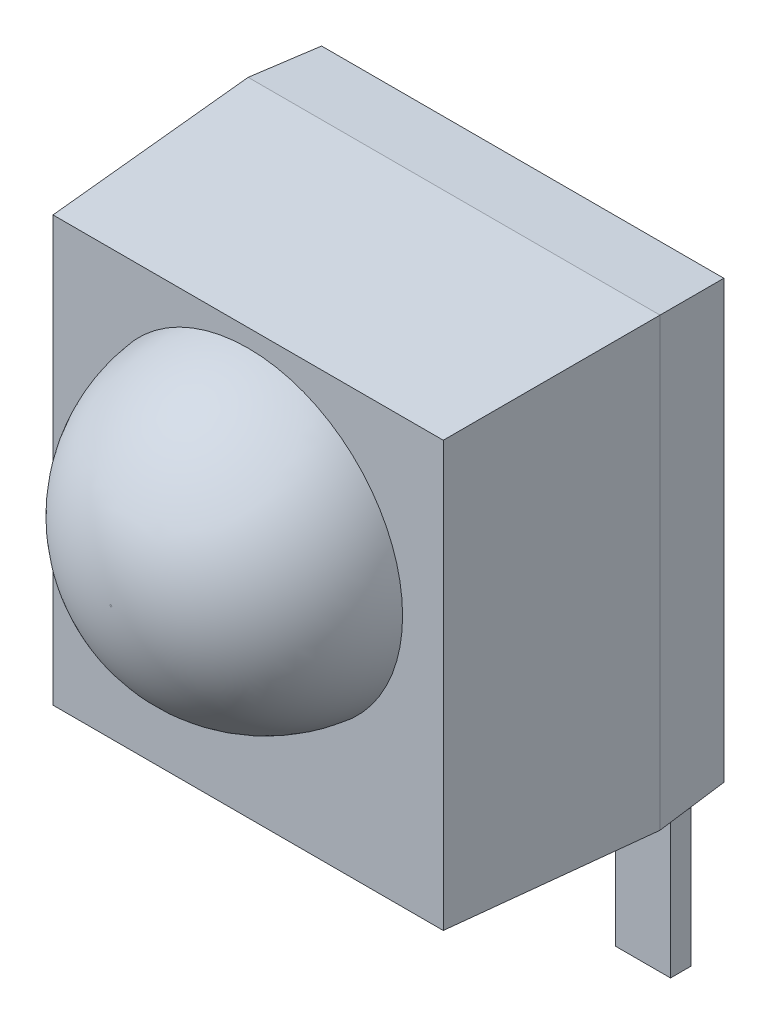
ISO-10303-21;
HEADER;
FILE_DESCRIPTION(('STEP AP214'),'2;1');
FILE_NAME('part.step','',(''),(''),'','','');
FILE_SCHEMA(('AUTOMOTIVE_DESIGN { 1 0 10303 214 1 1 1 1 }'));
ENDSEC;
DATA;
#1=APPLICATION_CONTEXT('core data for automotive mechanical design processes');
#2=APPLICATION_PROTOCOL_DEFINITION('international standard','automotive_design',2000,#1);
#3=PRODUCT_CONTEXT('',#1,'mechanical');
#4=PRODUCT('Part','Part','',(#3));
#5=PRODUCT_RELATED_PRODUCT_CATEGORY('part','',(#4));
#6=PRODUCT_DEFINITION_FORMATION('','',#4);
#7=PRODUCT_DEFINITION_CONTEXT('part definition',#1,'design');
#8=PRODUCT_DEFINITION('design','',#6,#7);
#9=PRODUCT_DEFINITION_SHAPE('','',#8);
#10=(LENGTH_UNIT() NAMED_UNIT(*) SI_UNIT(.MILLI.,.METRE.));
#11=(NAMED_UNIT(*) PLANE_ANGLE_UNIT() SI_UNIT($,.RADIAN.));
#12=(NAMED_UNIT(*) SI_UNIT($,.STERADIAN.) SOLID_ANGLE_UNIT());
#13=UNCERTAINTY_MEASURE_WITH_UNIT(LENGTH_MEASURE(1.E-05),#10,'distance_accuracy_value','');
#14=(GEOMETRIC_REPRESENTATION_CONTEXT(3) GLOBAL_UNCERTAINTY_ASSIGNED_CONTEXT((#13)) GLOBAL_UNIT_ASSIGNED_CONTEXT((#10,
#11,#12)) REPRESENTATION_CONTEXT('',''));
#15=CARTESIAN_POINT('',(0.,0.,0.));
#16=DIRECTION('',(0.,0.,1.));
#17=DIRECTION('',(1.,0.,0.));
#18=AXIS2_PLACEMENT_3D('',#15,#16,#17);
#19=CARTESIAN_POINT('',(0.0599999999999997,-2.,-0.513333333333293));
#20=DIRECTION('',(-1.,0.,0.));
#21=DIRECTION('',(0.,0.,1.));
#22=AXIS2_PLACEMENT_3D('',#19,#20,#21);
#23=PLANE('',#22);
#24=DIRECTION('',(0.,0.,1.));
#25=VECTOR('',#24,1.);
#26=CARTESIAN_POINT('',(0.0599999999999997,0.,-0.513333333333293));
#27=LINE('',#26,#25);
#28=CARTESIAN_POINT('',(0.0599999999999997,0.,-0.513333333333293));
#29=VERTEX_POINT('',#28);
#30=CARTESIAN_POINT('',(0.0599999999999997,0.,-0.213333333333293));
#31=VERTEX_POINT('',#30);
#32=EDGE_CURVE('E77',#29,#31,#27,.T.);
#33=ORIENTED_EDGE('',*,*,#32,.F.);
#34=DIRECTION('',(0.,1.,0.));
#35=VECTOR('',#34,1.);
#36=CARTESIAN_POINT('',(0.0599999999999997,-2.,-0.513333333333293));
#37=LINE('',#36,#35);
#38=CARTESIAN_POINT('',(0.0599999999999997,-2.,-0.513333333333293));
#39=VERTEX_POINT('',#38);
#40=EDGE_CURVE('E12',#39,#29,#37,.T.);
#41=ORIENTED_EDGE('',*,*,#40,.F.);
#42=DIRECTION('',(0.,0.,1.));
#43=VECTOR('',#42,1.);
#44=CARTESIAN_POINT('',(0.0599999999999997,-2.,-0.513333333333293));
#45=LINE('',#44,#43);
#46=CARTESIAN_POINT('',(0.0599999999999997,-2.,-0.213333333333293));
#47=VERTEX_POINT('',#46);
#48=EDGE_CURVE('E79',#39,#47,#45,.T.);
#49=ORIENTED_EDGE('',*,*,#48,.T.);
#50=DIRECTION('',(0.,1.,0.));
#51=VECTOR('',#50,1.);
#52=CARTESIAN_POINT('',(0.0599999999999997,-2.,-0.213333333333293));
#53=LINE('',#52,#51);
#54=EDGE_CURVE('E40',#47,#31,#53,.T.);
#55=ORIENTED_EDGE('',*,*,#54,.T.);
#56=EDGE_LOOP('',(#33,#41,#49,#55));
#57=FACE_BOUND('',#56,.T.);
#58=ADVANCED_FACE('F37',(#57),#23,.T.);
#59=CARTESIAN_POINT('',(0.0599999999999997,-2.,-0.513333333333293));
#60=DIRECTION('',(0.,0.,-1.));
#61=DIRECTION('',(-1.,0.,0.));
#62=AXIS2_PLACEMENT_3D('',#59,#60,#61);
#63=PLANE('',#62);
#64=DIRECTION('',(-1.,0.,0.));
#65=VECTOR('',#64,1.);
#66=CARTESIAN_POINT('',(0.0599999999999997,0.,-0.513333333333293));
#67=LINE('',#66,#65);
#68=CARTESIAN_POINT('',(0.86,0.,-0.513333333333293));
#69=VERTEX_POINT('',#68);
#70=EDGE_CURVE('E94',#69,#29,#67,.T.);
#71=ORIENTED_EDGE('',*,*,#70,.F.);
#72=DIRECTION('',(0.,1.,0.));
#73=VECTOR('',#72,1.);
#74=CARTESIAN_POINT('',(0.86,-2.,-0.513333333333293));
#75=LINE('',#74,#73);
#76=CARTESIAN_POINT('',(0.86,-2.,-0.513333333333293));
#77=VERTEX_POINT('',#76);
#78=EDGE_CURVE('E45',#77,#69,#75,.T.);
#79=ORIENTED_EDGE('',*,*,#78,.F.);
#80=DIRECTION('',(-1.,0.,0.));
#81=VECTOR('',#80,1.);
#82=CARTESIAN_POINT('',(0.0599999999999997,-2.,-0.513333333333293));
#83=LINE('',#82,#81);
#84=EDGE_CURVE('E84',#77,#39,#83,.T.);
#85=ORIENTED_EDGE('',*,*,#84,.T.);
#86=ORIENTED_EDGE('',*,*,#40,.T.);
#87=EDGE_LOOP('',(#71,#79,#85,#86));
#88=FACE_BOUND('',#87,.T.);
#89=ADVANCED_FACE('F109',(#88),#63,.T.);
#90=CARTESIAN_POINT('',(0.86,-2.,-0.513333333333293));
#91=DIRECTION('',(1.,0.,0.));
#92=DIRECTION('',(0.,0.,-1.));
#93=AXIS2_PLACEMENT_3D('',#90,#91,#92);
#94=PLANE('',#93);
#95=DIRECTION('',(0.,0.,-1.));
#96=VECTOR('',#95,1.);
#97=CARTESIAN_POINT('',(0.86,0.,-0.513333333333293));
#98=LINE('',#97,#96);
#99=CARTESIAN_POINT('',(0.86,0.,-0.213333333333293));
#100=VERTEX_POINT('',#99);
#101=EDGE_CURVE('E91',#100,#69,#98,.T.);
#102=ORIENTED_EDGE('',*,*,#101,.F.);
#103=DIRECTION('',(0.,1.,0.));
#104=VECTOR('',#103,1.);
#105=CARTESIAN_POINT('',(0.86,-2.,-0.213333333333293));
#106=LINE('',#105,#104);
#107=CARTESIAN_POINT('',(0.86,-2.,-0.213333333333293));
#108=VERTEX_POINT('',#107);
#109=EDGE_CURVE('E83',#108,#100,#106,.T.);
#110=ORIENTED_EDGE('',*,*,#109,.F.);
#111=DIRECTION('',(0.,0.,-1.));
#112=VECTOR('',#111,1.);
#113=CARTESIAN_POINT('',(0.86,-2.,-0.513333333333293));
#114=LINE('',#113,#112);
#115=EDGE_CURVE('E102',#108,#77,#114,.T.);
#116=ORIENTED_EDGE('',*,*,#115,.T.);
#117=ORIENTED_EDGE('',*,*,#78,.T.);
#118=EDGE_LOOP('',(#102,#110,#116,#117));
#119=FACE_BOUND('',#118,.T.);
#120=ADVANCED_FACE('F106',(#119),#94,.T.);
#121=CARTESIAN_POINT('',(0.0599999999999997,-2.,-0.213333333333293));
#122=DIRECTION('',(0.,0.,1.));
#123=DIRECTION('',(1.,0.,0.));
#124=AXIS2_PLACEMENT_3D('',#121,#122,#123);
#125=PLANE('',#124);
#126=DIRECTION('',(1.,0.,0.));
#127=VECTOR('',#126,1.);
#128=CARTESIAN_POINT('',(0.0599999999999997,0.,-0.213333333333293));
#129=LINE('',#128,#127);
#130=EDGE_CURVE('E86',#31,#100,#129,.T.);
#131=ORIENTED_EDGE('',*,*,#130,.F.);
#132=ORIENTED_EDGE('',*,*,#54,.F.);
#133=DIRECTION('',(1.,0.,0.));
#134=VECTOR('',#133,1.);
#135=CARTESIAN_POINT('',(0.0599999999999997,-2.,-0.213333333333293));
#136=LINE('',#135,#134);
#137=EDGE_CURVE('E100',#47,#108,#136,.T.);
#138=ORIENTED_EDGE('',*,*,#137,.T.);
#139=ORIENTED_EDGE('',*,*,#109,.T.);
#140=EDGE_LOOP('',(#131,#132,#138,#139));
#141=FACE_BOUND('',#140,.T.);
#142=ADVANCED_FACE('F87',(#141),#125,.T.);
#143=CARTESIAN_POINT('',(0.0599999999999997,-2.,-0.213333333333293));
#144=DIRECTION('',(0.,1.,0.));
#145=DIRECTION('',(0.,0.,1.));
#146=AXIS2_PLACEMENT_3D('',#143,#144,#145);
#147=PLANE('',#146);
#148=ORIENTED_EDGE('',*,*,#48,.F.);
#149=ORIENTED_EDGE('',*,*,#84,.F.);
#150=ORIENTED_EDGE('',*,*,#115,.F.);
#151=ORIENTED_EDGE('',*,*,#137,.F.);
#152=EDGE_LOOP('',(#148,#149,#150,#151));
#153=FACE_BOUND('',#152,.T.);
#154=ADVANCED_FACE('F111',(#153),#147,.F.);
#155=CARTESIAN_POINT('',(0.0599999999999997,0.,-0.213333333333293));
#156=DIRECTION('',(0.,1.,0.));
#157=DIRECTION('',(0.,0.,1.));
#158=AXIS2_PLACEMENT_3D('',#155,#156,#157);
#159=PLANE('',#158);
#160=ORIENTED_EDGE('',*,*,#32,.T.);
#161=ORIENTED_EDGE('',*,*,#130,.T.);
#162=ORIENTED_EDGE('',*,*,#101,.T.);
#163=ORIENTED_EDGE('',*,*,#70,.T.);
#164=EDGE_LOOP('',(#160,#161,#162,#163));
#165=FACE_BOUND('',#164,.T.);
#166=ADVANCED_FACE('F93',(#165),#159,.T.);
#167=CLOSED_SHELL('',(#58,#89,#120,#142,#154,#166));
#168=MANIFOLD_SOLID_BREP('B2',#167);
#169=CARTESIAN_POINT('',(5.14,-2.,-0.513333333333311));
#170=DIRECTION('',(-1.,0.,0.));
#171=DIRECTION('',(0.,0.,1.));
#172=AXIS2_PLACEMENT_3D('',#169,#170,#171);
#173=PLANE('',#172);
#174=DIRECTION('',(0.,0.,1.));
#175=VECTOR('',#174,1.);
#176=CARTESIAN_POINT('',(5.14,0.,-0.513333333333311));
#177=LINE('',#176,#175);
#178=CARTESIAN_POINT('',(5.14,0.,-0.513333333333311));
#179=VERTEX_POINT('',#178);
#180=CARTESIAN_POINT('',(5.14,0.,-0.213333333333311));
#181=VERTEX_POINT('',#180);
#182=EDGE_CURVE('E198',#179,#181,#177,.T.);
#183=ORIENTED_EDGE('',*,*,#182,.F.);
#184=DIRECTION('',(0.,1.,0.));
#185=VECTOR('',#184,1.);
#186=CARTESIAN_POINT('',(5.14,-2.,-0.513333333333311));
#187=LINE('',#186,#185);
#188=CARTESIAN_POINT('',(5.14,-2.,-0.513333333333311));
#189=VERTEX_POINT('',#188);
#190=EDGE_CURVE('E35',#189,#179,#187,.T.);
#191=ORIENTED_EDGE('',*,*,#190,.F.);
#192=DIRECTION('',(0.,0.,1.));
#193=VECTOR('',#192,1.);
#194=CARTESIAN_POINT('',(5.14,-2.,-0.513333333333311));
#195=LINE('',#194,#193);
#196=CARTESIAN_POINT('',(5.14,-2.,-0.213333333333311));
#197=VERTEX_POINT('',#196);
#198=EDGE_CURVE('E200',#189,#197,#195,.T.);
#199=ORIENTED_EDGE('',*,*,#198,.T.);
#200=DIRECTION('',(0.,1.,0.));
#201=VECTOR('',#200,1.);
#202=CARTESIAN_POINT('',(5.14,-2.,-0.213333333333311));
#203=LINE('',#202,#201);
#204=EDGE_CURVE('E161',#197,#181,#203,.T.);
#205=ORIENTED_EDGE('',*,*,#204,.T.);
#206=EDGE_LOOP('',(#183,#191,#199,#205));
#207=FACE_BOUND('',#206,.T.);
#208=ADVANCED_FACE('F158',(#207),#173,.T.);
#209=CARTESIAN_POINT('',(5.14,-2.,-0.513333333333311));
#210=DIRECTION('',(0.,0.,-1.));
#211=DIRECTION('',(-1.,0.,0.));
#212=AXIS2_PLACEMENT_3D('',#209,#210,#211);
#213=PLANE('',#212);
#214=DIRECTION('',(-1.,0.,0.));
#215=VECTOR('',#214,1.);
#216=CARTESIAN_POINT('',(5.14,0.,-0.513333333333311));
#217=LINE('',#216,#215);
#218=CARTESIAN_POINT('',(5.94,0.,-0.513333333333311));
#219=VERTEX_POINT('',#218);
#220=EDGE_CURVE('E215',#219,#179,#217,.T.);
#221=ORIENTED_EDGE('',*,*,#220,.F.);
#222=DIRECTION('',(0.,1.,0.));
#223=VECTOR('',#222,1.);
#224=CARTESIAN_POINT('',(5.94,-2.,-0.513333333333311));
#225=LINE('',#224,#223);
#226=CARTESIAN_POINT('',(5.94,-2.,-0.513333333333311));
#227=VERTEX_POINT('',#226);
#228=EDGE_CURVE('E166',#227,#219,#225,.T.);
#229=ORIENTED_EDGE('',*,*,#228,.F.);
#230=DIRECTION('',(-1.,0.,0.));
#231=VECTOR('',#230,1.);
#232=CARTESIAN_POINT('',(5.14,-2.,-0.513333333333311));
#233=LINE('',#232,#231);
#234=EDGE_CURVE('E205',#227,#189,#233,.T.);
#235=ORIENTED_EDGE('',*,*,#234,.T.);
#236=ORIENTED_EDGE('',*,*,#190,.T.);
#237=EDGE_LOOP('',(#221,#229,#235,#236));
#238=FACE_BOUND('',#237,.T.);
#239=ADVANCED_FACE('F230',(#238),#213,.T.);
#240=CARTESIAN_POINT('',(5.94,-2.,-0.513333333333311));
#241=DIRECTION('',(1.,0.,0.));
#242=DIRECTION('',(0.,0.,-1.));
#243=AXIS2_PLACEMENT_3D('',#240,#241,#242);
#244=PLANE('',#243);
#245=DIRECTION('',(0.,0.,-1.));
#246=VECTOR('',#245,1.);
#247=CARTESIAN_POINT('',(5.94,0.,-0.513333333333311));
#248=LINE('',#247,#246);
#249=CARTESIAN_POINT('',(5.94,0.,-0.213333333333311));
#250=VERTEX_POINT('',#249);
#251=EDGE_CURVE('E212',#250,#219,#248,.T.);
#252=ORIENTED_EDGE('',*,*,#251,.F.);
#253=DIRECTION('',(0.,1.,0.));
#254=VECTOR('',#253,1.);
#255=CARTESIAN_POINT('',(5.94,-2.,-0.213333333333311));
#256=LINE('',#255,#254);
#257=CARTESIAN_POINT('',(5.94,-2.,-0.213333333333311));
#258=VERTEX_POINT('',#257);
#259=EDGE_CURVE('E204',#258,#250,#256,.T.);
#260=ORIENTED_EDGE('',*,*,#259,.F.);
#261=DIRECTION('',(0.,0.,-1.));
#262=VECTOR('',#261,1.);
#263=CARTESIAN_POINT('',(5.94,-2.,-0.513333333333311));
#264=LINE('',#263,#262);
#265=EDGE_CURVE('E223',#258,#227,#264,.T.);
#266=ORIENTED_EDGE('',*,*,#265,.T.);
#267=ORIENTED_EDGE('',*,*,#228,.T.);
#268=EDGE_LOOP('',(#252,#260,#266,#267));
#269=FACE_BOUND('',#268,.T.);
#270=ADVANCED_FACE('F227',(#269),#244,.T.);
#271=CARTESIAN_POINT('',(5.14,-2.,-0.213333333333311));
#272=DIRECTION('',(0.,0.,1.));
#273=DIRECTION('',(1.,0.,0.));
#274=AXIS2_PLACEMENT_3D('',#271,#272,#273);
#275=PLANE('',#274);
#276=DIRECTION('',(1.,0.,0.));
#277=VECTOR('',#276,1.);
#278=CARTESIAN_POINT('',(5.14,0.,-0.213333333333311));
#279=LINE('',#278,#277);
#280=EDGE_CURVE('E207',#181,#250,#279,.T.);
#281=ORIENTED_EDGE('',*,*,#280,.F.);
#282=ORIENTED_EDGE('',*,*,#204,.F.);
#283=DIRECTION('',(1.,0.,0.));
#284=VECTOR('',#283,1.);
#285=CARTESIAN_POINT('',(5.14,-2.,-0.213333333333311));
#286=LINE('',#285,#284);
#287=EDGE_CURVE('E221',#197,#258,#286,.T.);
#288=ORIENTED_EDGE('',*,*,#287,.T.);
#289=ORIENTED_EDGE('',*,*,#259,.T.);
#290=EDGE_LOOP('',(#281,#282,#288,#289));
#291=FACE_BOUND('',#290,.T.);
#292=ADVANCED_FACE('F208',(#291),#275,.T.);
#293=CARTESIAN_POINT('',(5.14,-2.,-0.213333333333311));
#294=DIRECTION('',(0.,1.,0.));
#295=DIRECTION('',(0.,0.,1.));
#296=AXIS2_PLACEMENT_3D('',#293,#294,#295);
#297=PLANE('',#296);
#298=ORIENTED_EDGE('',*,*,#198,.F.);
#299=ORIENTED_EDGE('',*,*,#234,.F.);
#300=ORIENTED_EDGE('',*,*,#265,.F.);
#301=ORIENTED_EDGE('',*,*,#287,.F.);
#302=EDGE_LOOP('',(#298,#299,#300,#301));
#303=FACE_BOUND('',#302,.T.);
#304=ADVANCED_FACE('F232',(#303),#297,.F.);
#305=CARTESIAN_POINT('',(5.14,0.,-0.213333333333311));
#306=DIRECTION('',(0.,1.,0.));
#307=DIRECTION('',(0.,0.,1.));
#308=AXIS2_PLACEMENT_3D('',#305,#306,#307);
#309=PLANE('',#308);
#310=ORIENTED_EDGE('',*,*,#182,.T.);
#311=ORIENTED_EDGE('',*,*,#280,.T.);
#312=ORIENTED_EDGE('',*,*,#251,.T.);
#313=ORIENTED_EDGE('',*,*,#220,.T.);
#314=EDGE_LOOP('',(#310,#311,#312,#313));
#315=FACE_BOUND('',#314,.T.);
#316=ADVANCED_FACE('F214',(#315),#309,.T.);
#317=CLOSED_SHELL('',(#208,#239,#270,#292,#304,#316));
#318=MANIFOLD_SOLID_BREP('B6',#317);
#319=CARTESIAN_POINT('',(2.6,-2.,-0.513333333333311));
#320=DIRECTION('',(-1.,0.,0.));
#321=DIRECTION('',(0.,0.,1.));
#322=AXIS2_PLACEMENT_3D('',#319,#320,#321);
#323=PLANE('',#322);
#324=DIRECTION('',(0.,0.,1.));
#325=VECTOR('',#324,1.);
#326=CARTESIAN_POINT('',(2.6,0.,-0.513333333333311));
#327=LINE('',#326,#325);
#328=CARTESIAN_POINT('',(2.6,0.,-0.513333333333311));
#329=VERTEX_POINT('',#328);
#330=CARTESIAN_POINT('',(2.6,0.,-0.213333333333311));
#331=VERTEX_POINT('',#330);
#332=EDGE_CURVE('E318',#329,#331,#327,.T.);
#333=ORIENTED_EDGE('',*,*,#332,.F.);
#334=DIRECTION('',(0.,1.,0.));
#335=VECTOR('',#334,1.);
#336=CARTESIAN_POINT('',(2.6,-2.,-0.513333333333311));
#337=LINE('',#336,#335);
#338=CARTESIAN_POINT('',(2.6,-2.,-0.513333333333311));
#339=VERTEX_POINT('',#338);
#340=EDGE_CURVE('E156',#339,#329,#337,.T.);
#341=ORIENTED_EDGE('',*,*,#340,.F.);
#342=DIRECTION('',(0.,0.,1.));
#343=VECTOR('',#342,1.);
#344=CARTESIAN_POINT('',(2.6,-2.,-0.513333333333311));
#345=LINE('',#344,#343);
#346=CARTESIAN_POINT('',(2.6,-2.,-0.213333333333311));
#347=VERTEX_POINT('',#346);
#348=EDGE_CURVE('E320',#339,#347,#345,.T.);
#349=ORIENTED_EDGE('',*,*,#348,.T.);
#350=DIRECTION('',(0.,1.,0.));
#351=VECTOR('',#350,1.);
#352=CARTESIAN_POINT('',(2.6,-2.,-0.213333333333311));
#353=LINE('',#352,#351);
#354=EDGE_CURVE('E281',#347,#331,#353,.T.);
#355=ORIENTED_EDGE('',*,*,#354,.T.);
#356=EDGE_LOOP('',(#333,#341,#349,#355));
#357=FACE_BOUND('',#356,.T.);
#358=ADVANCED_FACE('F278',(#357),#323,.T.);
#359=CARTESIAN_POINT('',(2.6,-2.,-0.513333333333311));
#360=DIRECTION('',(0.,0.,-1.));
#361=DIRECTION('',(-1.,0.,0.));
#362=AXIS2_PLACEMENT_3D('',#359,#360,#361);
#363=PLANE('',#362);
#364=DIRECTION('',(-1.,0.,0.));
#365=VECTOR('',#364,1.);
#366=CARTESIAN_POINT('',(2.6,0.,-0.513333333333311));
#367=LINE('',#366,#365);
#368=CARTESIAN_POINT('',(3.4,0.,-0.513333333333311));
#369=VERTEX_POINT('',#368);
#370=EDGE_CURVE('E335',#369,#329,#367,.T.);
#371=ORIENTED_EDGE('',*,*,#370,.F.);
#372=DIRECTION('',(0.,1.,0.));
#373=VECTOR('',#372,1.);
#374=CARTESIAN_POINT('',(3.4,-2.,-0.513333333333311));
#375=LINE('',#374,#373);
#376=CARTESIAN_POINT('',(3.4,-2.,-0.513333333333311));
#377=VERTEX_POINT('',#376);
#378=EDGE_CURVE('E286',#377,#369,#375,.T.);
#379=ORIENTED_EDGE('',*,*,#378,.F.);
#380=DIRECTION('',(-1.,0.,0.));
#381=VECTOR('',#380,1.);
#382=CARTESIAN_POINT('',(2.6,-2.,-0.513333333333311));
#383=LINE('',#382,#381);
#384=EDGE_CURVE('E325',#377,#339,#383,.T.);
#385=ORIENTED_EDGE('',*,*,#384,.T.);
#386=ORIENTED_EDGE('',*,*,#340,.T.);
#387=EDGE_LOOP('',(#371,#379,#385,#386));
#388=FACE_BOUND('',#387,.T.);
#389=ADVANCED_FACE('F350',(#388),#363,.T.);
#390=CARTESIAN_POINT('',(3.4,-2.,-0.513333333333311));
#391=DIRECTION('',(1.,0.,0.));
#392=DIRECTION('',(0.,0.,-1.));
#393=AXIS2_PLACEMENT_3D('',#390,#391,#392);
#394=PLANE('',#393);
#395=DIRECTION('',(0.,0.,-1.));
#396=VECTOR('',#395,1.);
#397=CARTESIAN_POINT('',(3.4,0.,-0.513333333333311));
#398=LINE('',#397,#396);
#399=CARTESIAN_POINT('',(3.4,0.,-0.213333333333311));
#400=VERTEX_POINT('',#399);
#401=EDGE_CURVE('E332',#400,#369,#398,.T.);
#402=ORIENTED_EDGE('',*,*,#401,.F.);
#403=DIRECTION('',(0.,1.,0.));
#404=VECTOR('',#403,1.);
#405=CARTESIAN_POINT('',(3.4,-2.,-0.213333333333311));
#406=LINE('',#405,#404);
#407=CARTESIAN_POINT('',(3.4,-2.,-0.213333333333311));
#408=VERTEX_POINT('',#407);
#409=EDGE_CURVE('E324',#408,#400,#406,.T.);
#410=ORIENTED_EDGE('',*,*,#409,.F.);
#411=DIRECTION('',(0.,0.,-1.));
#412=VECTOR('',#411,1.);
#413=CARTESIAN_POINT('',(3.4,-2.,-0.513333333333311));
#414=LINE('',#413,#412);
#415=EDGE_CURVE('E343',#408,#377,#414,.T.);
#416=ORIENTED_EDGE('',*,*,#415,.T.);
#417=ORIENTED_EDGE('',*,*,#378,.T.);
#418=EDGE_LOOP('',(#402,#410,#416,#417));
#419=FACE_BOUND('',#418,.T.);
#420=ADVANCED_FACE('F347',(#419),#394,.T.);
#421=CARTESIAN_POINT('',(2.6,-2.,-0.213333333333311));
#422=DIRECTION('',(0.,0.,1.));
#423=DIRECTION('',(1.,0.,0.));
#424=AXIS2_PLACEMENT_3D('',#421,#422,#423);
#425=PLANE('',#424);
#426=DIRECTION('',(1.,0.,0.));
#427=VECTOR('',#426,1.);
#428=CARTESIAN_POINT('',(2.6,0.,-0.213333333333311));
#429=LINE('',#428,#427);
#430=EDGE_CURVE('E327',#331,#400,#429,.T.);
#431=ORIENTED_EDGE('',*,*,#430,.F.);
#432=ORIENTED_EDGE('',*,*,#354,.F.);
#433=DIRECTION('',(1.,0.,0.));
#434=VECTOR('',#433,1.);
#435=CARTESIAN_POINT('',(2.6,-2.,-0.213333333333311));
#436=LINE('',#435,#434);
#437=EDGE_CURVE('E341',#347,#408,#436,.T.);
#438=ORIENTED_EDGE('',*,*,#437,.T.);
#439=ORIENTED_EDGE('',*,*,#409,.T.);
#440=EDGE_LOOP('',(#431,#432,#438,#439));
#441=FACE_BOUND('',#440,.T.);
#442=ADVANCED_FACE('F328',(#441),#425,.T.);
#443=CARTESIAN_POINT('',(2.6,-2.,-0.213333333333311));
#444=DIRECTION('',(0.,1.,0.));
#445=DIRECTION('',(0.,0.,1.));
#446=AXIS2_PLACEMENT_3D('',#443,#444,#445);
#447=PLANE('',#446);
#448=ORIENTED_EDGE('',*,*,#348,.F.);
#449=ORIENTED_EDGE('',*,*,#384,.F.);
#450=ORIENTED_EDGE('',*,*,#415,.F.);
#451=ORIENTED_EDGE('',*,*,#437,.F.);
#452=EDGE_LOOP('',(#448,#449,#450,#451));
#453=FACE_BOUND('',#452,.T.);
#454=ADVANCED_FACE('F352',(#453),#447,.F.);
#455=CARTESIAN_POINT('',(2.6,0.,-0.213333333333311));
#456=DIRECTION('',(0.,1.,0.));
#457=DIRECTION('',(0.,0.,1.));
#458=AXIS2_PLACEMENT_3D('',#455,#456,#457);
#459=PLANE('',#458);
#460=ORIENTED_EDGE('',*,*,#332,.T.);
#461=ORIENTED_EDGE('',*,*,#430,.T.);
#462=ORIENTED_EDGE('',*,*,#401,.T.);
#463=ORIENTED_EDGE('',*,*,#370,.T.);
#464=EDGE_LOOP('',(#460,#461,#462,#463));
#465=FACE_BOUND('',#464,.T.);
#466=ADVANCED_FACE('F334',(#465),#459,.T.);
#467=CLOSED_SHELL('',(#358,#389,#420,#442,#454,#466));
#468=MANIFOLD_SOLID_BREP('B29',#467);
#469=CARTESIAN_POINT('',(0.,6.5,3.));
#470=DIRECTION('',(0.,0.,-1.));
#471=DIRECTION('',(-1.,0.,0.));
#472=AXIS2_PLACEMENT_3D('',#469,#470,#471);
#473=PLANE('',#472);
#474=DIRECTION('',(0.,1.,0.));
#475=VECTOR('',#474,1.);
#476=CARTESIAN_POINT('',(0.157223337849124,6.5,3.));
#477=LINE('',#476,#475);
#478=CARTESIAN_POINT('',(0.157223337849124,6.34277666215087,3.));
#479=VERTEX_POINT('',#478);
#480=CARTESIAN_POINT('',(0.157223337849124,0.157223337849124,3.));
#481=VERTEX_POINT('',#480);
#482=EDGE_CURVE('E487',#479,#481,#477,.F.);
#483=ORIENTED_EDGE('',*,*,#482,.T.);
#484=DIRECTION('',(-1.,0.,0.));
#485=VECTOR('',#484,1.);
#486=CARTESIAN_POINT('',(0.,0.157223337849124,3.));
#487=LINE('',#486,#485);
#488=CARTESIAN_POINT('',(5.84277666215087,0.157223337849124,3.));
#489=VERTEX_POINT('',#488);
#490=EDGE_CURVE('E468',#481,#489,#487,.F.);
#491=ORIENTED_EDGE('',*,*,#490,.T.);
#492=DIRECTION('',(0.,-1.,0.));
#493=VECTOR('',#492,1.);
#494=CARTESIAN_POINT('',(5.84277666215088,6.5,3.));
#495=LINE('',#494,#493);
#496=CARTESIAN_POINT('',(5.84277666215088,6.34277666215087,3.));
#497=VERTEX_POINT('',#496);
#498=EDGE_CURVE('E409',#489,#497,#495,.F.);
#499=ORIENTED_EDGE('',*,*,#498,.T.);
#500=DIRECTION('',(1.,0.,0.));
#501=VECTOR('',#500,1.);
#502=CARTESIAN_POINT('',(0.,6.34277666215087,3.));
#503=LINE('',#502,#501);
#504=EDGE_CURVE('E404',#497,#479,#503,.F.);
#505=ORIENTED_EDGE('',*,*,#504,.T.);
#506=EDGE_LOOP('',(#483,#491,#499,#505));
#507=FACE_BOUND('',#506,.T.);
#508=CARTESIAN_POINT('',(3.,3.83355555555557,3.));
#509=DIRECTION('',(0.,0.,-1.));
#510=DIRECTION('',(-1.,0.,0.));
#511=AXIS2_PLACEMENT_3D('',#508,#509,#510);
#512=CIRCLE('',#511,2.25);
#513=CARTESIAN_POINT('',(0.75,3.83355555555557,3.));
#514=VERTEX_POINT('',#513);
#515=EDGE_CURVE('E397',#514,#514,#512,.F.);
#516=ORIENTED_EDGE('',*,*,#515,.F.);
#517=EDGE_LOOP('',(#516));
#518=FACE_BOUND('',#517,.T.);
#519=ADVANCED_FACE('F389',(#507,#518),#473,.F.);
#520=CARTESIAN_POINT('',(0.,0.,0.));
#521=DIRECTION('',(-0.998629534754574,0.,0.0523359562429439));
#522=DIRECTION('',(0.0523359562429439,0.,0.998629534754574));
#523=AXIS2_PLACEMENT_3D('',#520,#521,#522);
#524=PLANE('',#523);
#525=DIRECTION('',(0.,-1.,0.));
#526=VECTOR('',#525,1.);
#527=CARTESIAN_POINT('',(0.,0.,0.));
#528=LINE('',#527,#526);
#529=CARTESIAN_POINT('',(0.,6.5,0.));
#530=VERTEX_POINT('',#529);
#531=CARTESIAN_POINT('',(0.,0.,0.));
#532=VERTEX_POINT('',#531);
#533=EDGE_CURVE('E446',#530,#532,#528,.T.);
#534=ORIENTED_EDGE('',*,*,#533,.T.);
#535=DIRECTION('',(-0.052264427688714,-0.052264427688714,-0.997264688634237));
#536=VECTOR('',#535,1.);
#537=CARTESIAN_POINT('',(0.,0.,0.));
#538=LINE('',#537,#536);
#539=EDGE_CURVE('E467',#481,#532,#538,.T.);
#540=ORIENTED_EDGE('',*,*,#539,.F.);
#541=ORIENTED_EDGE('',*,*,#482,.F.);
#542=DIRECTION('',(-0.052264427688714,0.052264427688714,-0.997264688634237));
#543=VECTOR('',#542,1.);
#544=CARTESIAN_POINT('',(0.0177552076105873,6.48224479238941,0.338789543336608));
#545=LINE('',#544,#543);
#546=EDGE_CURVE('E475',#479,#530,#545,.T.);
#547=ORIENTED_EDGE('',*,*,#546,.T.);
#548=EDGE_LOOP('',(#534,#540,#541,#547));
#549=FACE_BOUND('',#548,.T.);
#550=ADVANCED_FACE('F474',(#549),#524,.T.);
#551=CARTESIAN_POINT('',(0.,0.,0.));
#552=DIRECTION('',(0.,-0.998629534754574,0.0523359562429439));
#553=DIRECTION('',(0.,-0.0523359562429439,-0.998629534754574));
#554=AXIS2_PLACEMENT_3D('',#551,#552,#553);
#555=PLANE('',#554);
#556=DIRECTION('',(1.,0.,0.));
#557=VECTOR('',#556,1.);
#558=CARTESIAN_POINT('',(0.,0.,0.));
#559=LINE('',#558,#557);
#560=CARTESIAN_POINT('',(6.,0.,0.));
#561=VERTEX_POINT('',#560);
#562=EDGE_CURVE('E458',#532,#561,#559,.T.);
#563=ORIENTED_EDGE('',*,*,#562,.T.);
#564=DIRECTION('',(0.052264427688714,-0.052264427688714,-0.997264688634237));
#565=VECTOR('',#564,1.);
#566=CARTESIAN_POINT('',(6.,0.,0.));
#567=LINE('',#566,#565);
#568=EDGE_CURVE('E471',#489,#561,#567,.T.);
#569=ORIENTED_EDGE('',*,*,#568,.F.);
#570=ORIENTED_EDGE('',*,*,#490,.F.);
#571=ORIENTED_EDGE('',*,*,#539,.T.);
#572=EDGE_LOOP('',(#563,#569,#570,#571));
#573=FACE_BOUND('',#572,.T.);
#574=ADVANCED_FACE('F391',(#573),#555,.T.);
#575=CARTESIAN_POINT('',(6.,0.,0.));
#576=DIRECTION('',(0.998629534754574,0.,0.0523359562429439));
#577=DIRECTION('',(0.0523359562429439,0.,-0.998629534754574));
#578=AXIS2_PLACEMENT_3D('',#575,#576,#577);
#579=PLANE('',#578);
#580=DIRECTION('',(0.,1.,0.));
#581=VECTOR('',#580,1.);
#582=CARTESIAN_POINT('',(6.,0.,0.));
#583=LINE('',#582,#581);
#584=CARTESIAN_POINT('',(6.,6.5,0.));
#585=VERTEX_POINT('',#584);
#586=EDGE_CURVE('E464',#561,#585,#583,.T.);
#587=ORIENTED_EDGE('',*,*,#586,.T.);
#588=DIRECTION('',(0.0522644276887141,0.052264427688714,-0.997264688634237));
#589=VECTOR('',#588,1.);
#590=CARTESIAN_POINT('',(5.98361057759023,6.48361057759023,0.312728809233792));
#591=LINE('',#590,#589);
#592=EDGE_CURVE('E490',#497,#585,#591,.T.);
#593=ORIENTED_EDGE('',*,*,#592,.F.);
#594=ORIENTED_EDGE('',*,*,#498,.F.);
#595=ORIENTED_EDGE('',*,*,#568,.T.);
#596=EDGE_LOOP('',(#587,#593,#594,#595));
#597=FACE_BOUND('',#596,.T.);
#598=ADVANCED_FACE('F517',(#597),#579,.T.);
#599=CARTESIAN_POINT('',(0.,6.5,0.));
#600=DIRECTION('',(0.,0.998629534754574,0.0523359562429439));
#601=DIRECTION('',(0.,-0.0523359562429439,0.998629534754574));
#602=AXIS2_PLACEMENT_3D('',#599,#600,#601);
#603=PLANE('',#602);
#604=DIRECTION('',(-1.,0.,0.));
#605=VECTOR('',#604,1.);
#606=CARTESIAN_POINT('',(0.,6.5,0.));
#607=LINE('',#606,#605);
#608=EDGE_CURVE('E486',#585,#530,#607,.T.);
#609=ORIENTED_EDGE('',*,*,#608,.T.);
#610=ORIENTED_EDGE('',*,*,#546,.F.);
#611=ORIENTED_EDGE('',*,*,#504,.F.);
#612=ORIENTED_EDGE('',*,*,#592,.T.);
#613=EDGE_LOOP('',(#609,#610,#611,#612));
#614=FACE_BOUND('',#613,.T.);
#615=ADVANCED_FACE('F515',(#614),#603,.T.);
#616=CARTESIAN_POINT('',(0.,0.,0.));
#617=DIRECTION('',(-0.997564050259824,0.,-0.0697564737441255));
#618=DIRECTION('',(-0.0697564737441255,0.,0.997564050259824));
#619=AXIS2_PLACEMENT_3D('',#616,#617,#618);
#620=PLANE('',#619);
#621=ORIENTED_EDGE('',*,*,#533,.F.);
#622=DIRECTION('',(-0.0695873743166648,0.0695873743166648,0.995145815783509));
#623=VECTOR('',#622,1.);
#624=CARTESIAN_POINT('',(0.,6.5,0.));
#625=LINE('',#624,#623);
#626=CARTESIAN_POINT('',(0.0699268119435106,6.43007318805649,-1.));
#627=VERTEX_POINT('',#626);
#628=EDGE_CURVE('E476',#627,#530,#625,.T.);
#629=ORIENTED_EDGE('',*,*,#628,.F.);
#630=DIRECTION('',(0.,-1.,0.));
#631=VECTOR('',#630,1.);
#632=CARTESIAN_POINT('',(0.0699268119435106,0.,-1.));
#633=LINE('',#632,#631);
#634=CARTESIAN_POINT('',(0.0699268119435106,0.0699268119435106,-1.));
#635=VERTEX_POINT('',#634);
#636=EDGE_CURVE('E449',#627,#635,#633,.T.);
#637=ORIENTED_EDGE('',*,*,#636,.T.);
#638=DIRECTION('',(-0.0695873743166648,-0.0695873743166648,0.995145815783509));
#639=VECTOR('',#638,1.);
#640=CARTESIAN_POINT('',(0.,0.,0.));
#641=LINE('',#640,#639);
#642=EDGE_CURVE('E442',#635,#532,#641,.T.);
#643=ORIENTED_EDGE('',*,*,#642,.T.);
#644=EDGE_LOOP('',(#621,#629,#637,#643));
#645=FACE_BOUND('',#644,.T.);
#646=ADVANCED_FACE('F444',(#645),#620,.T.);
#647=CARTESIAN_POINT('',(0.,6.5,0.));
#648=DIRECTION('',(0.,0.997564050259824,-0.0697564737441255));
#649=DIRECTION('',(0.,0.0697564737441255,0.997564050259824));
#650=AXIS2_PLACEMENT_3D('',#647,#648,#649);
#651=PLANE('',#650);
#652=ORIENTED_EDGE('',*,*,#608,.F.);
#653=DIRECTION('',(0.0695873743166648,0.0695873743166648,0.995145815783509));
#654=VECTOR('',#653,1.);
#655=CARTESIAN_POINT('',(5.96852438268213,6.46852438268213,-0.450122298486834));
#656=LINE('',#655,#654);
#657=CARTESIAN_POINT('',(5.93007318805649,6.43007318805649,-1.));
#658=VERTEX_POINT('',#657);
#659=EDGE_CURVE('E478',#658,#585,#656,.T.);
#660=ORIENTED_EDGE('',*,*,#659,.F.);
#661=DIRECTION('',(-1.,0.,0.));
#662=VECTOR('',#661,1.);
#663=CARTESIAN_POINT('',(0.,6.43007318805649,-1.));
#664=LINE('',#663,#662);
#665=EDGE_CURVE('E454',#658,#627,#664,.T.);
#666=ORIENTED_EDGE('',*,*,#665,.T.);
#667=ORIENTED_EDGE('',*,*,#628,.T.);
#668=EDGE_LOOP('',(#652,#660,#666,#667));
#669=FACE_BOUND('',#668,.T.);
#670=ADVANCED_FACE('F512',(#669),#651,.T.);
#671=CARTESIAN_POINT('',(6.,0.,0.));
#672=DIRECTION('',(0.997564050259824,0.,-0.0697564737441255));
#673=DIRECTION('',(-0.0697564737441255,0.,-0.997564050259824));
#674=AXIS2_PLACEMENT_3D('',#671,#672,#673);
#675=PLANE('',#674);
#676=ORIENTED_EDGE('',*,*,#586,.F.);
#677=DIRECTION('',(0.0695873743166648,-0.0695873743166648,0.995145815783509));
#678=VECTOR('',#677,1.);
#679=CARTESIAN_POINT('',(5.97094558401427,0.0290544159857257,-0.415497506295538));
#680=LINE('',#679,#678);
#681=CARTESIAN_POINT('',(5.93007318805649,0.0699268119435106,-1.));
#682=VERTEX_POINT('',#681);
#683=EDGE_CURVE('E453',#682,#561,#680,.T.);
#684=ORIENTED_EDGE('',*,*,#683,.F.);
#685=DIRECTION('',(0.,1.,0.));
#686=VECTOR('',#685,1.);
#687=CARTESIAN_POINT('',(5.93007318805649,0.,-1.));
#688=LINE('',#687,#686);
#689=EDGE_CURVE('E534',#682,#658,#688,.T.);
#690=ORIENTED_EDGE('',*,*,#689,.T.);
#691=ORIENTED_EDGE('',*,*,#659,.T.);
#692=EDGE_LOOP('',(#676,#684,#690,#691));
#693=FACE_BOUND('',#692,.T.);
#694=ADVANCED_FACE('F538',(#693),#675,.T.);
#695=CARTESIAN_POINT('',(0.,0.,0.));
#696=DIRECTION('',(0.,-0.997564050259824,-0.0697564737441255));
#697=DIRECTION('',(0.,0.0697564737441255,-0.997564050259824));
#698=AXIS2_PLACEMENT_3D('',#695,#696,#697);
#699=PLANE('',#698);
#700=ORIENTED_EDGE('',*,*,#562,.F.);
#701=ORIENTED_EDGE('',*,*,#642,.F.);
#702=DIRECTION('',(1.,0.,0.));
#703=VECTOR('',#702,1.);
#704=CARTESIAN_POINT('',(0.,0.0699268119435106,-1.));
#705=LINE('',#704,#703);
#706=EDGE_CURVE('E481',#635,#682,#705,.T.);
#707=ORIENTED_EDGE('',*,*,#706,.T.);
#708=ORIENTED_EDGE('',*,*,#683,.T.);
#709=EDGE_LOOP('',(#700,#701,#707,#708));
#710=FACE_BOUND('',#709,.T.);
#711=ADVANCED_FACE('F460',(#710),#699,.T.);
#712=CARTESIAN_POINT('',(0.,6.5,-1.));
#713=DIRECTION('',(0.,0.,-1.));
#714=DIRECTION('',(-1.,0.,0.));
#715=AXIS2_PLACEMENT_3D('',#712,#713,#714);
#716=PLANE('',#715);
#717=ORIENTED_EDGE('',*,*,#636,.F.);
#718=ORIENTED_EDGE('',*,*,#665,.F.);
#719=ORIENTED_EDGE('',*,*,#689,.F.);
#720=ORIENTED_EDGE('',*,*,#706,.F.);
#721=EDGE_LOOP('',(#717,#718,#719,#720));
#722=FACE_BOUND('',#721,.T.);
#723=ADVANCED_FACE('F531',(#722),#716,.T.);
#724=CARTESIAN_POINT('',(3.,3.83355555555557,5.));
#725=DIRECTION('',(0.,0.,1.));
#726=DIRECTION('',(1.,0.,0.));
#727=AXIS2_PLACEMENT_3D('',#724,#725,#726);
#728=PLANE('',#727);
#729=CARTESIAN_POINT('',(3.,3.83355555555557,5.));
#730=DIRECTION('',(0.,0.,1.));
#731=DIRECTION('',(1.,0.,0.));
#732=AXIS2_PLACEMENT_3D('',#729,#730,#731);
#733=CIRCLE('',#732,0.0139320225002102);
#734=CARTESIAN_POINT('',(3.01393202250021,3.83355555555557,5.));
#735=VERTEX_POINT('',#734);
#736=EDGE_CURVE('E276',#735,#735,#733,.T.);
#737=ORIENTED_EDGE('',*,*,#736,.T.);
#738=EDGE_LOOP('',(#737));
#739=FACE_BOUND('',#738,.T.);
#740=ADVANCED_FACE('F549',(#739),#728,.T.);
#741=CARTESIAN_POINT('',(3.,3.83355555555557,2.75));
#742=DIRECTION('',(0.,0.,-1.));
#743=DIRECTION('',(-1.,0.,0.));
#744=AXIS2_PLACEMENT_3D('',#741,#742,#743);
#745=DEGENERATE_TOROIDAL_SURFACE('',#744,0.0139320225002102,2.25,.T.);
#746=ORIENTED_EDGE('',*,*,#515,.T.);
#747=EDGE_LOOP('',(#746));
#748=FACE_BOUND('',#747,.T.);
#749=ORIENTED_EDGE('',*,*,#736,.F.);
#750=EDGE_LOOP('',(#749));
#751=FACE_BOUND('',#750,.T.);
#752=ADVANCED_FACE('F500',(#748,#751),#745,.T.);
#753=CLOSED_SHELL('',(#519,#550,#574,#598,#615,#646,#670,#694,#711,#723,#740,#752));
#754=MANIFOLD_SOLID_BREP('B150',#753);
#755=ADVANCED_BREP_SHAPE_REPRESENTATION('',(#18,#168,#318,#468,#754),#14);
#756=SHAPE_DEFINITION_REPRESENTATION(#9,#755);
ENDSEC;
END-ISO-10303-21;
